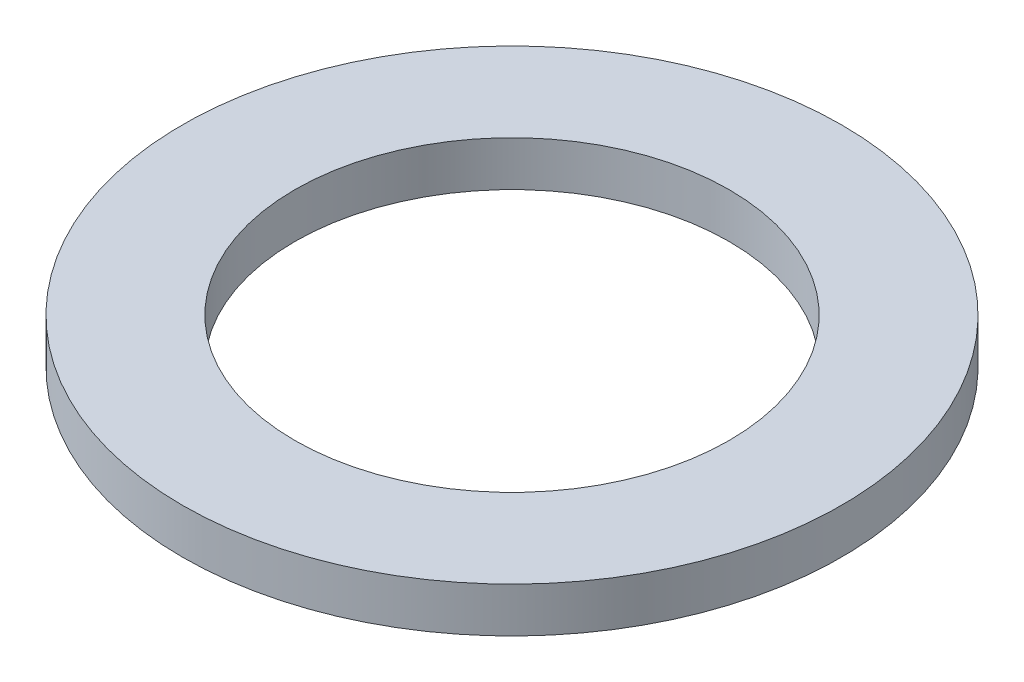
from build123d import *

# Parameters (mm, degrees)
ESQUISSE1_W = 3.75
ESQUISSE1_H = 1.5


with BuildPart() as part:
    # Esquisse1 → R_volution1 (revolve)
    with BuildSketch(Plane.XY, mode=Mode.PRIVATE) as r_volution1_sk:
        with Locations((9.125, 0.75)):
            Rectangle(ESQUISSE1_W, ESQUISSE1_H)
    revolve(r_volution1_sk.sketch.rotate(Axis((0, 0, 0), (0, 1, 0)), 90), axis=Axis((0, 0, 0), (0, 1, 0)))


solid = part.part
